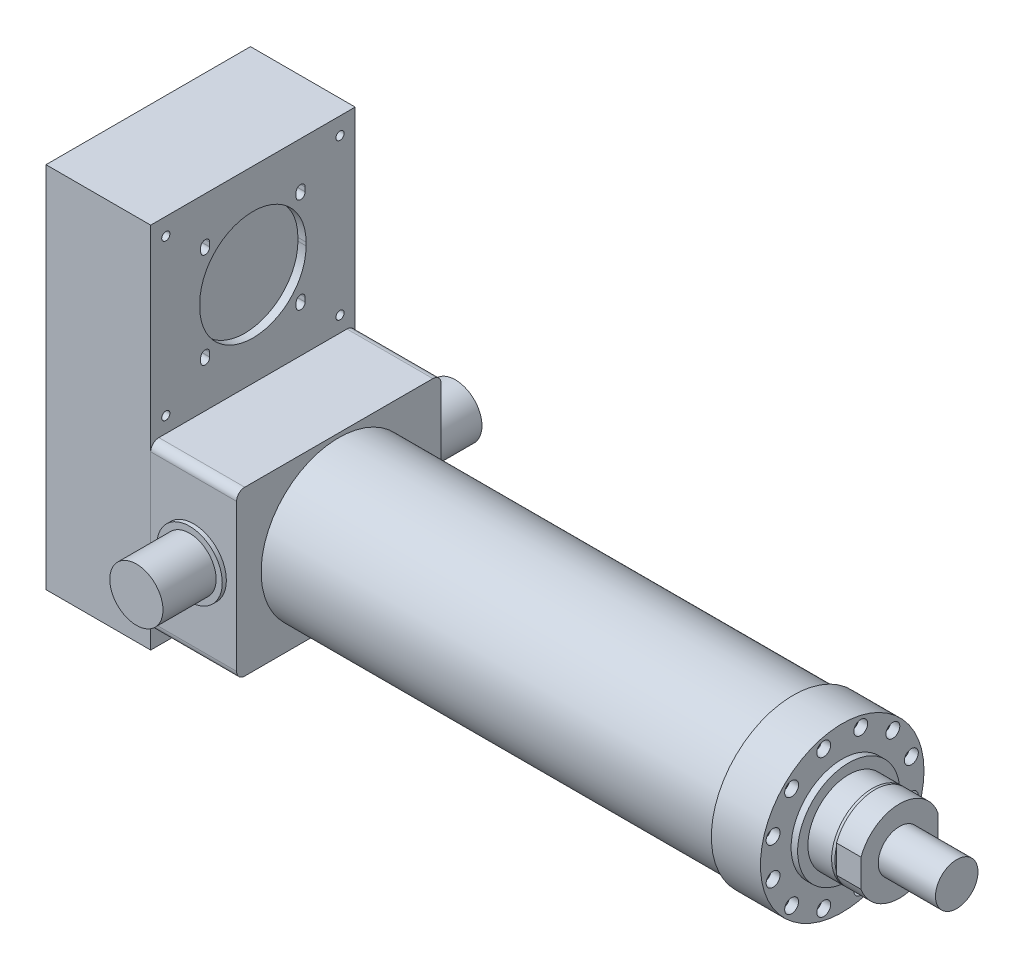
from build123d import *

# Parameters (mm, degrees)
SKETCH_1_R           = 95
SKETCH_1_R_2         = 80
EXTRUDE_1_DEPTH      = 555.5
SKETCH_2_R           = 100
EXTRUDE_2_DEPTH      = 60
SKETCH_3_R           = 62.5
EXTRUDE_3_DEPTH      = 8
SKETCH_4_R           = 8.5
CUT_EXTRUDE_3_DEPTH  = 11
SKETCH_6_R           = 50
EXTRUDE_4_DEPTH      = 32
CHAMFER_1_SIZE       = 3
CHAMFER_1_SIZE2      = 1.091910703
EXTRUDE_5_DEPTH      = 30
SKETCH_8_R           = 26
CUT_EXTRUDE_4_DEPTH  = 82
EXTRUDE_6_DEPTH      = 105
SKETCH_14_W          = 250
SKETCH_14_H          = 450
EXTRUDE_8_DEPTH      = 128
SKETCH_16_R          = 26
EXTRUDE_9_DEPTH      = 70
SKETCH_4_6_R         = 5.5
CUT_EXTRUDE_13_DEPTH = 92
SKETCH_17_R          = 32.5
EXTRUDE_10_DEPTH     = 70
EXTRUDE_START        = -250
SKETCH_17_2_R        = 32.5
EXTRUDE_11_DEPTH     = 70
SKETCH_15_R          = 5
CUT_EXTRUDE_14_DEPTH = 10
SKETCH_18_R          = 40
SKETCH_18_R_2        = 32.5
EXTRUDE_12_DEPTH     = 5
SKETCH_18_2_R        = 40
SKETCH_18_2_R_2      = 32.5
EXTRUDE_13_DEPTH     = 5


with BuildPart() as part:
    # Sketch 1 → Extrude 1 (new body)
    with BuildSketch(Plane(origin=(0, 0, 0), x_dir=(0, 0, -1), z_dir=(1, 0, 0))):
        Circle(SKETCH_1_R)
        Circle(SKETCH_1_R_2, mode=Mode.SUBTRACT)
    extrude(amount=EXTRUDE_1_DEPTH)

    # Sketch 2 → Extrude 2 (add)
    with BuildSketch(Plane(origin=(555.5, 0, 0), x_dir=(0, 0, -1), z_dir=(1, 0, 0))):
        Circle(SKETCH_2_R)
    extrude(amount=EXTRUDE_2_DEPTH)

    # Sketch 3 → Extrude 3 (add)
    with BuildSketch(Plane(origin=(615.5, 0, 0), x_dir=(0, 0, -1), z_dir=(1, 0, 0))):
        Circle(SKETCH_3_R)
    extrude(amount=EXTRUDE_3_DEPTH)

    # Sketch 4 → Cut-Extrude 3 (cut)
    with BuildSketch(Plane(origin=(615.5, 0, 0), x_dir=(0, 0, -1), z_dir=(1, 0, 0))):
        with Locations((-22.646666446, 84.5185098)):
            Circle(SKETCH_4_R)
        with Locations((22.646666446, 84.5185098)):
            Circle(SKETCH_4_R)
        with Locations((61.871843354, 61.871843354)):
            Circle(SKETCH_4_R)
        with Locations((84.5185098, 22.646666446)):
            Circle(SKETCH_4_R)
        with Locations((84.5185098, -22.646666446)):
            Circle(SKETCH_4_R)
        with Locations((61.871843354, -61.871843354)):
            Circle(SKETCH_4_R)
        with Locations((22.646666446, -84.5185098)):
            Circle(SKETCH_4_R)
        with Locations((-22.646666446, -84.5185098)):
            Circle(SKETCH_4_R)
        with Locations((-61.871843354, -61.871843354)):
            Circle(SKETCH_4_R)
        with Locations((-84.5185098, -22.646666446)):
            Circle(SKETCH_4_R)
        with Locations((-84.5185098, 22.646666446)):
            Circle(SKETCH_4_R)
        with Locations((-61.871843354, 61.871843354)):
            Circle(SKETCH_4_R)
    extrude(amount=-CUT_EXTRUDE_3_DEPTH, mode=Mode.SUBTRACT)

    # Sketch 6 → Extrude 4 (add)
    with BuildSketch(Plane(origin=(623.5, 0, 0), x_dir=(0, 0, -1), z_dir=(1, 0, 0))):
        Circle(SKETCH_6_R)
    extrude(amount=EXTRUDE_4_DEPTH)

    # Chamfer 1
    chamfer_1_edges = [part.edges().sort_by_distance(p)[0] for p in [
        (655.5, 0, 50),
    ]]
    chamfer_1_side = [part.faces().sort_by_distance(p)[0] for p in [
        (639.5, 0, 50),
    ]]
    chamfer(chamfer_1_edges, length=CHAMFER_1_SIZE, length2=CHAMFER_1_SIZE2, reference=chamfer_1_side[0])

    # Sketch 7 → Extrude 5 (add)
    with BuildSketch(Plane(origin=(655.5, 0, 0), x_dir=(0, 0, -1), z_dir=(1, 0, 0))):
        with BuildLine():
            Line((-47, 17.058722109), (-47, -17.058722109))
            ThreePointArc((-47, -17.058722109), (0, -50), (47, -17.058722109))
            Line((47, -17.058722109), (47, 17.058722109))
            ThreePointArc((47, 17.058722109), (0, 50), (-47, 17.058722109))
        make_face()
    extrude(amount=EXTRUDE_5_DEPTH)

    # Sketch 8 → Cut-Extrude 4 (cut)
    with BuildSketch(Plane(origin=(685.5, 0, 0), x_dir=(0, 0, -1), z_dir=(1, 0, 0))):
        Circle(SKETCH_8_R)
    extrude(amount=-CUT_EXTRUDE_4_DEPTH, mode=Mode.SUBTRACT)

    # Sketch 4_6 → Cut-Extrude 13 (cut)
    with BuildSketch(Plane(origin=(615.5, 0, 0), x_dir=(0, 0, -1), z_dir=(1, 0, 0))):
        with Locations((-22.646666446, 84.5185098)):
            Circle(SKETCH_4_6_R)
        with Locations((22.646666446, 84.5185098)):
            Circle(SKETCH_4_6_R)
        with Locations((61.871843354, 61.871843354)):
            Circle(SKETCH_4_6_R)
        with Locations((84.5185098, 22.646666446)):
            Circle(SKETCH_4_6_R)
        with Locations((84.5185098, -22.646666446)):
            Circle(SKETCH_4_6_R)
        with Locations((61.871843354, -61.871843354)):
            Circle(SKETCH_4_6_R)
        with Locations((22.646666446, -84.5185098)):
            Circle(SKETCH_4_6_R)
        with Locations((-22.646666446, -84.5185098)):
            Circle(SKETCH_4_6_R)
        with Locations((-61.871843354, -61.871843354)):
            Circle(SKETCH_4_6_R)
        with Locations((-84.5185098, -22.646666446)):
            Circle(SKETCH_4_6_R)
        with Locations((-84.5185098, 22.646666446)):
            Circle(SKETCH_4_6_R)
        with Locations((-61.871843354, 61.871843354)):
            Circle(SKETCH_4_6_R)
    extrude(amount=-CUT_EXTRUDE_13_DEPTH, mode=Mode.SUBTRACT)


with BuildPart() as body_2:
    # Sketch 9 → Extrude 6 (new body)
    with BuildSketch(Plane.ZY):
        with BuildLine():
            Line((-115, 100), (115, 100))
            ThreePointArc((115, 100), (122.071067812, 97.071067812), (125, 90))
            Line((125, 90), (125, -90))
            ThreePointArc((125, -90), (122.071067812, -97.071067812), (115, -100))
            Line((115, -100), (-115, -100))
            ThreePointArc((-115, -100), (-122.071067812, -97.071067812), (-125, -90))
            Line((-125, -90), (-125, 90))
            ThreePointArc((-125, 90), (-122.071067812, 97.071067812), (-115, 100))
        make_face()
    extrude(amount=EXTRUDE_6_DEPTH)



with BuildPart() as body_3:
    # Sketch 14 → Extrude 8 (new body)
    with BuildSketch(Plane.ZY.offset(105)):
        with Locations((0, 105)):
            Rectangle(SKETCH_14_W, SKETCH_14_H)
    extrude(amount=EXTRUDE_8_DEPTH)

    # Sketch 15 → Cut-Extrude 14 (cut)
    with BuildSketch(Plane(origin=(-105, 0, 0), x_dir=(0, 0, -1), z_dir=(1, 0, 0))):
        with Locations((-106.5, 309)):
            Circle(SKETCH_15_R)
        with Locations((106.5, 309)):
            Circle(SKETCH_15_R)
        with Locations((106.5, 119)):
            Circle(SKETCH_15_R)
        with Locations((-106.5, 119)):
            Circle(SKETCH_15_R)
        with BuildLine():
            Line((-65, 217), (-65, 213))
            ThreePointArc((-65, 213), (0, 148), (65, 213))
            Line((65, 213), (65, 217))
            ThreePointArc((65, 217), (0, 282), (-65, 217))
        make_face()
        with BuildLine():
            Line((-63.836309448, 270.836309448), (-63.836309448, 275.836309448))
            ThreePointArc((-63.836309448, 275.836309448), (-58.336309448, 281.336309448), (-52.836309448, 275.836309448))
            Line((-52.836309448, 275.836309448), (-52.836309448, 270.836309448))
            ThreePointArc((-52.836309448, 270.836309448), (-58.336309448, 265.336309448), (-63.836309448, 270.836309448))
        make_face()
        with BuildLine():
            Line((63.836309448, 270.836309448), (63.836309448, 275.836309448))
            ThreePointArc((63.836309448, 275.836309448), (58.336309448, 281.336309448), (52.836309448, 275.836309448))
            Line((52.836309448, 275.836309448), (52.836309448, 270.836309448))
            ThreePointArc((52.836309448, 270.836309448), (58.336309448, 265.336309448), (63.836309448, 270.836309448))
        make_face()
        with BuildLine():
            Line((63.836309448, 159.163690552), (63.836309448, 154.163690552))
            ThreePointArc((63.836309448, 154.163690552), (58.336309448, 148.663690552), (52.836309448, 154.163690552))
            Line((52.836309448, 154.163690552), (52.836309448, 159.163690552))
            ThreePointArc((52.836309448, 159.163690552), (58.336309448, 164.663690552), (63.836309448, 159.163690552))
        make_face()
        with BuildLine():
            Line((-63.836309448, 159.163690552), (-63.836309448, 154.163690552))
            ThreePointArc((-63.836309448, 154.163690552), (-58.336309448, 148.663690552), (-52.836309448, 154.163690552))
            Line((-52.836309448, 154.163690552), (-52.836309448, 159.163690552))
            ThreePointArc((-52.836309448, 159.163690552), (-58.336309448, 164.663690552), (-63.836309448, 159.163690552))
        make_face()
    extrude(amount=-CUT_EXTRUDE_14_DEPTH, mode=Mode.SUBTRACT)


with BuildPart() as body_4:
    # Sketch 16 → Extrude 9 (new body)
    with BuildSketch(Plane(origin=(685.5, 0, 0), x_dir=(0, 0, -1), z_dir=(1, 0, 0))):
        Circle(SKETCH_16_R)
    extrude(amount=EXTRUDE_9_DEPTH)


with BuildPart() as body_5:
    # Sketch 17 → Extrude 10 (new body)
    with BuildSketch(Plane.XY.offset(125)):
        with Locations((-52.5, 0)):
            Circle(SKETCH_17_R)
    extrude(amount=EXTRUDE_10_DEPTH)


with BuildPart() as body_6:
    # Sketch 17_2 → Extrude 11 (new body)
    with BuildSketch(Plane.XY.offset(125).offset(EXTRUDE_START)):
        with Locations((-52.5, 0)):
            Circle(SKETCH_17_2_R)
    extrude(amount=-EXTRUDE_11_DEPTH)


with BuildPart() as body_2_1:
    add(body_2.part)

    add(body_5.part)  # Extrude 12 merges body 5
    # Sketch 18 → Extrude 12 (add)
    with BuildSketch(Plane.XY.offset(125)):
        with Locations(Location((-52.5, 0, 0), (0, 0, 90))):
            Circle(SKETCH_18_R)
        with Locations((-52.5, 0)):
            Circle(SKETCH_18_R_2, mode=Mode.SUBTRACT)
    extrude(amount=EXTRUDE_12_DEPTH)


    add(body_6.part)  # Extrude 13 merges body 6
    # Sketch 18_2 → Extrude 13 (add)
    with BuildSketch(Plane.XY.offset(125).offset(EXTRUDE_START)):
        with Locations((-52.5, 0)):
            Circle(SKETCH_18_2_R)
        with Locations((-52.5, 0)):
            Circle(SKETCH_18_2_R_2, mode=Mode.SUBTRACT)
    extrude(amount=-EXTRUDE_13_DEPTH)


solid = Compound([part.part, body_3.part, body_4.part, body_2_1.part])
